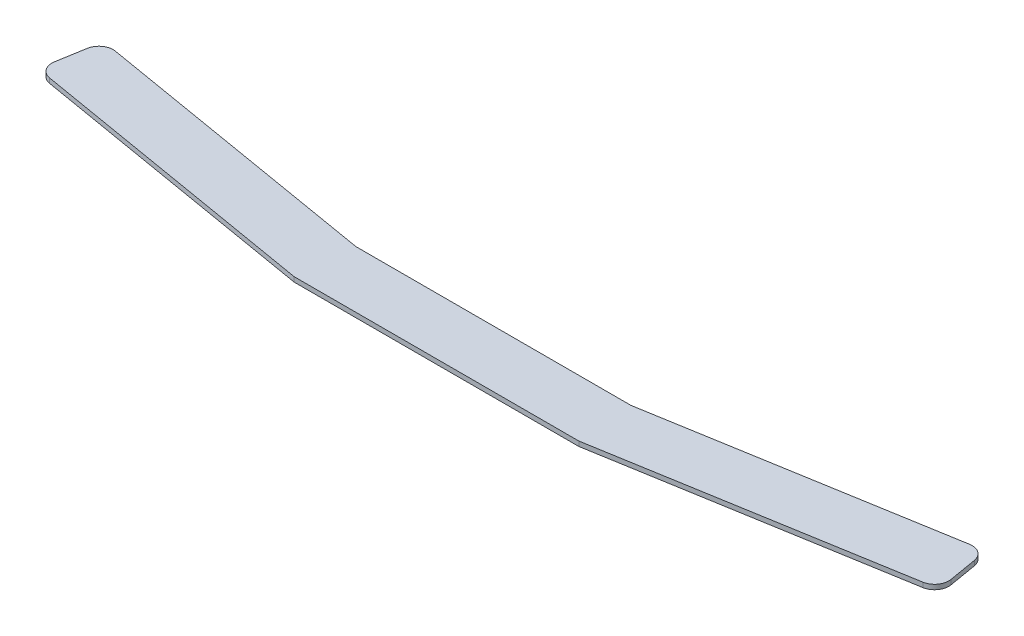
ISO-10303-21;
HEADER;
FILE_DESCRIPTION(('STEP AP214'),'2;1');
FILE_NAME('part.step','',(''),(''),'','','');
FILE_SCHEMA(('AUTOMOTIVE_DESIGN { 1 0 10303 214 1 1 1 1 }'));
ENDSEC;
DATA;
#1=APPLICATION_CONTEXT('core data for automotive mechanical design processes');
#2=APPLICATION_PROTOCOL_DEFINITION('international standard','automotive_design',2000,#1);
#3=PRODUCT_CONTEXT('',#1,'mechanical');
#4=PRODUCT('Part','Part','',(#3));
#5=PRODUCT_RELATED_PRODUCT_CATEGORY('part','',(#4));
#6=PRODUCT_DEFINITION_FORMATION('','',#4);
#7=PRODUCT_DEFINITION_CONTEXT('part definition',#1,'design');
#8=PRODUCT_DEFINITION('design','',#6,#7);
#9=PRODUCT_DEFINITION_SHAPE('','',#8);
#10=(LENGTH_UNIT() NAMED_UNIT(*) SI_UNIT(.MILLI.,.METRE.));
#11=(NAMED_UNIT(*) PLANE_ANGLE_UNIT() SI_UNIT($,.RADIAN.));
#12=(NAMED_UNIT(*) SI_UNIT($,.STERADIAN.) SOLID_ANGLE_UNIT());
#13=UNCERTAINTY_MEASURE_WITH_UNIT(LENGTH_MEASURE(1.E-05),#10,'distance_accuracy_value','');
#14=(GEOMETRIC_REPRESENTATION_CONTEXT(3) GLOBAL_UNCERTAINTY_ASSIGNED_CONTEXT((#13)) GLOBAL_UNIT_ASSIGNED_CONTEXT((#10,
#11,#12)) REPRESENTATION_CONTEXT('',''));
#15=CARTESIAN_POINT('',(0.,0.,0.));
#16=DIRECTION('',(0.,0.,1.));
#17=DIRECTION('',(1.,0.,0.));
#18=AXIS2_PLACEMENT_3D('',#15,#16,#17);
#19=CARTESIAN_POINT('',(30.0000000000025,1.,0.));
#20=DIRECTION('',(-0.166858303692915,0.,-0.985980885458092));
#21=DIRECTION('',(-0.985980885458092,0.,0.166858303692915));
#22=AXIS2_PLACEMENT_3D('',#19,#20,#21);
#23=PLANE('',#22);
#24=DIRECTION('',(0.985980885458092,0.,-0.166858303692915));
#25=VECTOR('',#24,1.);
#26=CARTESIAN_POINT('',(30.0000000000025,0.,0.));
#27=LINE('',#26,#25);
#28=CARTESIAN_POINT('',(30.0000000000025,0.,0.));
#29=VERTEX_POINT('',#28);
#30=CARTESIAN_POINT('',(92.0420573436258,0.,-10.4994250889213));
#31=VERTEX_POINT('',#30);
#32=EDGE_CURVE('E153',#29,#31,#27,.T.);
#33=ORIENTED_EDGE('',*,*,#32,.T.);
#34=DIRECTION('',(0.,-1.,0.));
#35=VECTOR('',#34,1.);
#36=CARTESIAN_POINT('',(92.0420573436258,1.,-10.4994250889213));
#37=LINE('',#36,#35);
#38=CARTESIAN_POINT('',(92.0420573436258,1.,-10.4994250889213));
#39=VERTEX_POINT('',#38);
#40=EDGE_CURVE('E11',#39,#31,#37,.T.);
#41=ORIENTED_EDGE('',*,*,#40,.F.);
#42=DIRECTION('',(0.985980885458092,0.,-0.166858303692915));
#43=VECTOR('',#42,1.);
#44=CARTESIAN_POINT('',(30.0000000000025,1.,0.));
#45=LINE('',#44,#43);
#46=CARTESIAN_POINT('',(30.0000000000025,1.,0.));
#47=VERTEX_POINT('',#46);
#48=EDGE_CURVE('E175',#47,#39,#45,.T.);
#49=ORIENTED_EDGE('',*,*,#48,.F.);
#50=DIRECTION('',(0.,-1.,0.));
#51=VECTOR('',#50,1.);
#52=CARTESIAN_POINT('',(30.0000000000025,1.,0.));
#53=LINE('',#52,#51);
#54=EDGE_CURVE('E149',#47,#29,#53,.T.);
#55=ORIENTED_EDGE('',*,*,#54,.T.);
#56=EDGE_LOOP('',(#33,#41,#49,#55));
#57=FACE_BOUND('',#56,.T.);
#58=ADVANCED_FACE('F33',(#57),#23,.F.);
#59=CARTESIAN_POINT('',(91.541482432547,1.,-13.4573677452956));
#60=DIRECTION('',(0.,-1.,0.));
#61=DIRECTION('',(0.,0.,-1.));
#62=AXIS2_PLACEMENT_3D('',#59,#60,#61);
#63=CYLINDRICAL_SURFACE('',#62,3.00000000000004);
#64=CARTESIAN_POINT('',(91.541482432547,0.,-13.4573677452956));
#65=DIRECTION('',(0.,1.,0.));
#66=DIRECTION('',(0.,0.,1.));
#67=AXIS2_PLACEMENT_3D('',#64,#65,#66);
#68=CIRCLE('',#67,3.00000000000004);
#69=CARTESIAN_POINT('',(94.4994250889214,0.,-13.9579426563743));
#70=VERTEX_POINT('',#69);
#71=EDGE_CURVE('E156',#31,#70,#68,.T.);
#72=ORIENTED_EDGE('',*,*,#71,.T.);
#73=DIRECTION('',(0.,-1.,0.));
#74=VECTOR('',#73,1.);
#75=CARTESIAN_POINT('',(94.4994250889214,1.,-13.9579426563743));
#76=LINE('',#75,#74);
#77=CARTESIAN_POINT('',(94.4994250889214,1.,-13.9579426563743));
#78=VERTEX_POINT('',#77);
#79=EDGE_CURVE('E41',#78,#70,#76,.T.);
#80=ORIENTED_EDGE('',*,*,#79,.F.);
#81=CARTESIAN_POINT('',(91.541482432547,1.,-13.4573677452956));
#82=DIRECTION('',(0.,1.,0.));
#83=DIRECTION('',(0.,0.,1.));
#84=AXIS2_PLACEMENT_3D('',#81,#82,#83);
#85=CIRCLE('',#84,3.00000000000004);
#86=EDGE_CURVE('E104',#39,#78,#85,.T.);
#87=ORIENTED_EDGE('',*,*,#86,.F.);
#88=ORIENTED_EDGE('',*,*,#40,.T.);
#89=EDGE_LOOP('',(#72,#80,#87,#88));
#90=FACE_BOUND('',#89,.T.);
#91=ADVANCED_FACE('F253',(#90),#63,.T.);
#92=CARTESIAN_POINT('',(94.4994250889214,1.,-13.9579426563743));
#93=DIRECTION('',(-0.985980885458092,0.,0.166858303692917));
#94=DIRECTION('',(0.166858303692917,0.,0.985980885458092));
#95=AXIS2_PLACEMENT_3D('',#92,#93,#94);
#96=PLANE('',#95);
#97=DIRECTION('',(-0.166858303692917,0.,-0.985980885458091));
#98=VECTOR('',#97,1.);
#99=CARTESIAN_POINT('',(94.4994250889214,0.,-13.9579426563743));
#100=LINE('',#99,#98);
#101=CARTESIAN_POINT('',(93.4982752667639,0.,-19.8738279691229));
#102=VERTEX_POINT('',#101);
#103=EDGE_CURVE('E158',#70,#102,#100,.T.);
#104=ORIENTED_EDGE('',*,*,#103,.T.);
#105=DIRECTION('',(0.,-1.,0.));
#106=VECTOR('',#105,1.);
#107=CARTESIAN_POINT('',(93.4982752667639,1.,-19.8738279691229));
#108=LINE('',#107,#106);
#109=CARTESIAN_POINT('',(93.4982752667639,1.,-19.8738279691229));
#110=VERTEX_POINT('',#109);
#111=EDGE_CURVE('E194',#110,#102,#108,.T.);
#112=ORIENTED_EDGE('',*,*,#111,.F.);
#113=DIRECTION('',(-0.166858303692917,0.,-0.985980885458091));
#114=VECTOR('',#113,1.);
#115=CARTESIAN_POINT('',(94.4994250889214,1.,-13.9579426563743));
#116=LINE('',#115,#114);
#117=EDGE_CURVE('E202',#78,#110,#116,.T.);
#118=ORIENTED_EDGE('',*,*,#117,.F.);
#119=ORIENTED_EDGE('',*,*,#79,.T.);
#120=EDGE_LOOP('',(#104,#112,#118,#119));
#121=FACE_BOUND('',#120,.T.);
#122=ADVANCED_FACE('F200',(#121),#96,.F.);
#123=CARTESIAN_POINT('',(90.5403326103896,1.,-19.3732530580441));
#124=DIRECTION('',(0.,-1.,0.));
#125=DIRECTION('',(0.,0.,-1.));
#126=AXIS2_PLACEMENT_3D('',#123,#124,#125);
#127=CYLINDRICAL_SURFACE('',#126,3.00000000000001);
#128=CARTESIAN_POINT('',(90.5403326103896,0.,-19.3732530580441));
#129=DIRECTION('',(0.,1.,0.));
#130=DIRECTION('',(0.,0.,1.));
#131=AXIS2_PLACEMENT_3D('',#128,#129,#130);
#132=CIRCLE('',#131,3.00000000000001);
#133=CARTESIAN_POINT('',(90.0397576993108,0.,-22.3311957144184));
#134=VERTEX_POINT('',#133);
#135=EDGE_CURVE('E160',#102,#134,#132,.T.);
#136=ORIENTED_EDGE('',*,*,#135,.T.);
#137=DIRECTION('',(0.,-1.,0.));
#138=VECTOR('',#137,1.);
#139=CARTESIAN_POINT('',(90.0397576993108,1.,-22.3311957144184));
#140=LINE('',#139,#138);
#141=CARTESIAN_POINT('',(90.0397576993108,1.,-22.3311957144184));
#142=VERTEX_POINT('',#141);
#143=EDGE_CURVE('E191',#142,#134,#140,.T.);
#144=ORIENTED_EDGE('',*,*,#143,.F.);
#145=CARTESIAN_POINT('',(90.5403326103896,1.,-19.3732530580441));
#146=DIRECTION('',(0.,1.,0.));
#147=DIRECTION('',(0.,0.,1.));
#148=AXIS2_PLACEMENT_3D('',#145,#146,#147);
#149=CIRCLE('',#148,3.00000000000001);
#150=EDGE_CURVE('E220',#110,#142,#149,.T.);
#151=ORIENTED_EDGE('',*,*,#150,.F.);
#152=ORIENTED_EDGE('',*,*,#111,.T.);
#153=EDGE_LOOP('',(#136,#144,#151,#152));
#154=FACE_BOUND('',#153,.T.);
#155=ADVANCED_FACE('F211',(#154),#127,.T.);
#156=CARTESIAN_POINT('',(28.9917830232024,1.,-11.9999999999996));
#157=DIRECTION('',(0.166858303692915,0.,0.985980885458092));
#158=DIRECTION('',(0.985980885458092,0.,-0.166858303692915));
#159=AXIS2_PLACEMENT_3D('',#156,#157,#158);
#160=PLANE('',#159);
#161=DIRECTION('',(-0.985980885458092,0.,0.166858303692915));
#162=VECTOR('',#161,1.);
#163=CARTESIAN_POINT('',(28.9917830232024,0.,-11.9999999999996));
#164=LINE('',#163,#162);
#165=CARTESIAN_POINT('',(28.9917830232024,0.,-11.9999999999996));
#166=VERTEX_POINT('',#165);
#167=EDGE_CURVE('E162',#134,#166,#164,.T.);
#168=ORIENTED_EDGE('',*,*,#167,.T.);
#169=DIRECTION('',(0.,-1.,0.));
#170=VECTOR('',#169,1.);
#171=CARTESIAN_POINT('',(28.9917830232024,1.,-11.9999999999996));
#172=LINE('',#171,#170);
#173=CARTESIAN_POINT('',(28.9917830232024,1.,-11.9999999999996));
#174=VERTEX_POINT('',#173);
#175=EDGE_CURVE('E188',#174,#166,#172,.T.);
#176=ORIENTED_EDGE('',*,*,#175,.F.);
#177=DIRECTION('',(-0.985980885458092,0.,0.166858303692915));
#178=VECTOR('',#177,1.);
#179=CARTESIAN_POINT('',(28.9917830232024,1.,-11.9999999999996));
#180=LINE('',#179,#178);
#181=EDGE_CURVE('E217',#142,#174,#180,.T.);
#182=ORIENTED_EDGE('',*,*,#181,.F.);
#183=ORIENTED_EDGE('',*,*,#143,.T.);
#184=EDGE_LOOP('',(#168,#176,#182,#183));
#185=FACE_BOUND('',#184,.T.);
#186=ADVANCED_FACE('F215',(#185),#160,.F.);
#187=CARTESIAN_POINT('',(-28.9917830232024,1.,-11.9999999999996));
#188=DIRECTION('',(0.,0.,1.));
#189=DIRECTION('',(1.,0.,0.));
#190=AXIS2_PLACEMENT_3D('',#187,#188,#189);
#191=PLANE('',#190);
#192=DIRECTION('',(-1.,0.,0.));
#193=VECTOR('',#192,1.);
#194=CARTESIAN_POINT('',(-28.9917830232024,0.,-11.9999999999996));
#195=LINE('',#194,#193);
#196=CARTESIAN_POINT('',(-28.9917830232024,0.,-11.9999999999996));
#197=VERTEX_POINT('',#196);
#198=EDGE_CURVE('E164',#166,#197,#195,.T.);
#199=ORIENTED_EDGE('',*,*,#198,.T.);
#200=DIRECTION('',(0.,-1.,0.));
#201=VECTOR('',#200,1.);
#202=CARTESIAN_POINT('',(-28.9917830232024,1.,-11.9999999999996));
#203=LINE('',#202,#201);
#204=CARTESIAN_POINT('',(-28.9917830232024,1.,-11.9999999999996));
#205=VERTEX_POINT('',#204);
#206=EDGE_CURVE('E185',#205,#197,#203,.T.);
#207=ORIENTED_EDGE('',*,*,#206,.F.);
#208=DIRECTION('',(-1.,0.,0.));
#209=VECTOR('',#208,1.);
#210=CARTESIAN_POINT('',(-28.9917830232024,1.,-11.9999999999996));
#211=LINE('',#210,#209);
#212=EDGE_CURVE('E219',#174,#205,#211,.T.);
#213=ORIENTED_EDGE('',*,*,#212,.F.);
#214=ORIENTED_EDGE('',*,*,#175,.T.);
#215=EDGE_LOOP('',(#199,#207,#213,#214));
#216=FACE_BOUND('',#215,.T.);
#217=ADVANCED_FACE('F266',(#216),#191,.F.);
#218=CARTESIAN_POINT('',(-28.9917830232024,1.,-11.9999999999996));
#219=DIRECTION('',(-0.166858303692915,0.,0.985980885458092));
#220=DIRECTION('',(0.985980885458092,0.,0.166858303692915));
#221=AXIS2_PLACEMENT_3D('',#218,#219,#220);
#222=PLANE('',#221);
#223=DIRECTION('',(-0.985980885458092,0.,-0.166858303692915));
#224=VECTOR('',#223,1.);
#225=CARTESIAN_POINT('',(-28.9917830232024,0.,-11.9999999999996));
#226=LINE('',#225,#224);
#227=CARTESIAN_POINT('',(-90.0397576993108,0.,-22.3311957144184));
#228=VERTEX_POINT('',#227);
#229=EDGE_CURVE('E166',#197,#228,#226,.T.);
#230=ORIENTED_EDGE('',*,*,#229,.T.);
#231=DIRECTION('',(0.,-1.,0.));
#232=VECTOR('',#231,1.);
#233=CARTESIAN_POINT('',(-90.0397576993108,1.,-22.3311957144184));
#234=LINE('',#233,#232);
#235=CARTESIAN_POINT('',(-90.0397576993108,1.,-22.3311957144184));
#236=VERTEX_POINT('',#235);
#237=EDGE_CURVE('E182',#236,#228,#234,.T.);
#238=ORIENTED_EDGE('',*,*,#237,.F.);
#239=DIRECTION('',(-0.985980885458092,0.,-0.166858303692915));
#240=VECTOR('',#239,1.);
#241=CARTESIAN_POINT('',(-28.9917830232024,1.,-11.9999999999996));
#242=LINE('',#241,#240);
#243=EDGE_CURVE('E222',#205,#236,#242,.T.);
#244=ORIENTED_EDGE('',*,*,#243,.F.);
#245=ORIENTED_EDGE('',*,*,#206,.T.);
#246=EDGE_LOOP('',(#230,#238,#244,#245));
#247=FACE_BOUND('',#246,.T.);
#248=ADVANCED_FACE('F269',(#247),#222,.F.);
#249=CARTESIAN_POINT('',(-90.5403326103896,1.,-19.3732530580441));
#250=DIRECTION('',(0.,-1.,0.));
#251=DIRECTION('',(0.,0.,-1.));
#252=AXIS2_PLACEMENT_3D('',#249,#250,#251);
#253=CYLINDRICAL_SURFACE('',#252,3.00000000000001);
#254=CARTESIAN_POINT('',(-90.5403326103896,0.,-19.3732530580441));
#255=DIRECTION('',(0.,1.,0.));
#256=DIRECTION('',(0.,0.,-1.));
#257=AXIS2_PLACEMENT_3D('',#254,#255,#256);
#258=CIRCLE('',#257,3.00000000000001);
#259=CARTESIAN_POINT('',(-93.4982752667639,0.,-19.8738279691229));
#260=VERTEX_POINT('',#259);
#261=EDGE_CURVE('E168',#228,#260,#258,.T.);
#262=ORIENTED_EDGE('',*,*,#261,.T.);
#263=DIRECTION('',(0.,-1.,0.));
#264=VECTOR('',#263,1.);
#265=CARTESIAN_POINT('',(-93.4982752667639,1.,-19.8738279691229));
#266=LINE('',#265,#264);
#267=CARTESIAN_POINT('',(-93.4982752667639,1.,-19.8738279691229));
#268=VERTEX_POINT('',#267);
#269=EDGE_CURVE('E179',#268,#260,#266,.T.);
#270=ORIENTED_EDGE('',*,*,#269,.F.);
#271=CARTESIAN_POINT('',(-90.5403326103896,1.,-19.3732530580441));
#272=DIRECTION('',(0.,1.,0.));
#273=DIRECTION('',(0.,0.,-1.));
#274=AXIS2_PLACEMENT_3D('',#271,#272,#273);
#275=CIRCLE('',#274,3.00000000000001);
#276=EDGE_CURVE('E228',#236,#268,#275,.T.);
#277=ORIENTED_EDGE('',*,*,#276,.F.);
#278=ORIENTED_EDGE('',*,*,#237,.T.);
#279=EDGE_LOOP('',(#262,#270,#277,#278));
#280=FACE_BOUND('',#279,.T.);
#281=ADVANCED_FACE('F234',(#280),#253,.T.);
#282=CARTESIAN_POINT('',(-94.4994250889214,1.,-13.9579426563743));
#283=DIRECTION('',(0.985980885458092,0.,0.166858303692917));
#284=DIRECTION('',(0.166858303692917,0.,-0.985980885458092));
#285=AXIS2_PLACEMENT_3D('',#282,#283,#284);
#286=PLANE('',#285);
#287=DIRECTION('',(-0.166858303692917,0.,0.985980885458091));
#288=VECTOR('',#287,1.);
#289=CARTESIAN_POINT('',(-94.4994250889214,0.,-13.9579426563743));
#290=LINE('',#289,#288);
#291=CARTESIAN_POINT('',(-94.4994250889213,0.,-13.9579426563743));
#292=VERTEX_POINT('',#291);
#293=EDGE_CURVE('E170',#260,#292,#290,.T.);
#294=ORIENTED_EDGE('',*,*,#293,.T.);
#295=DIRECTION('',(0.,-1.,0.));
#296=VECTOR('',#295,1.);
#297=CARTESIAN_POINT('',(-94.4994250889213,1.,-13.9579426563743));
#298=LINE('',#297,#296);
#299=CARTESIAN_POINT('',(-94.4994250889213,1.,-13.9579426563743));
#300=VERTEX_POINT('',#299);
#301=EDGE_CURVE('E144',#300,#292,#298,.T.);
#302=ORIENTED_EDGE('',*,*,#301,.F.);
#303=DIRECTION('',(-0.166858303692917,0.,0.985980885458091));
#304=VECTOR('',#303,1.);
#305=CARTESIAN_POINT('',(-94.4994250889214,1.,-13.9579426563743));
#306=LINE('',#305,#304);
#307=EDGE_CURVE('E135',#268,#300,#306,.T.);
#308=ORIENTED_EDGE('',*,*,#307,.F.);
#309=ORIENTED_EDGE('',*,*,#269,.T.);
#310=EDGE_LOOP('',(#294,#302,#308,#309));
#311=FACE_BOUND('',#310,.T.);
#312=ADVANCED_FACE('F238',(#311),#286,.F.);
#313=CARTESIAN_POINT('',(-91.541482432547,1.,-13.4573677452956));
#314=DIRECTION('',(0.,-1.,0.));
#315=DIRECTION('',(0.,0.,-1.));
#316=AXIS2_PLACEMENT_3D('',#313,#314,#315);
#317=CYLINDRICAL_SURFACE('',#316,3.00000000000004);
#318=CARTESIAN_POINT('',(-91.541482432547,0.,-13.4573677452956));
#319=DIRECTION('',(0.,1.,0.));
#320=DIRECTION('',(0.,0.,-1.));
#321=AXIS2_PLACEMENT_3D('',#318,#319,#320);
#322=CIRCLE('',#321,3.00000000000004);
#323=CARTESIAN_POINT('',(-92.0420573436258,0.,-10.4994250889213));
#324=VERTEX_POINT('',#323);
#325=EDGE_CURVE('E143',#292,#324,#322,.T.);
#326=ORIENTED_EDGE('',*,*,#325,.T.);
#327=DIRECTION('',(0.,-1.,0.));
#328=VECTOR('',#327,1.);
#329=CARTESIAN_POINT('',(-92.0420573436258,1.,-10.4994250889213));
#330=LINE('',#329,#328);
#331=CARTESIAN_POINT('',(-92.0420573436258,1.,-10.4994250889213));
#332=VERTEX_POINT('',#331);
#333=EDGE_CURVE('E140',#332,#324,#330,.T.);
#334=ORIENTED_EDGE('',*,*,#333,.F.);
#335=CARTESIAN_POINT('',(-91.541482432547,1.,-13.4573677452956));
#336=DIRECTION('',(0.,1.,0.));
#337=DIRECTION('',(0.,0.,-1.));
#338=AXIS2_PLACEMENT_3D('',#335,#336,#337);
#339=CIRCLE('',#338,3.00000000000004);
#340=EDGE_CURVE('E129',#300,#332,#339,.T.);
#341=ORIENTED_EDGE('',*,*,#340,.F.);
#342=ORIENTED_EDGE('',*,*,#301,.T.);
#343=EDGE_LOOP('',(#326,#334,#341,#342));
#344=FACE_BOUND('',#343,.T.);
#345=ADVANCED_FACE('F141',(#344),#317,.T.);
#346=CARTESIAN_POINT('',(-30.0000000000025,1.,0.));
#347=DIRECTION('',(0.166858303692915,0.,-0.985980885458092));
#348=DIRECTION('',(-0.985980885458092,0.,-0.166858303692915));
#349=AXIS2_PLACEMENT_3D('',#346,#347,#348);
#350=PLANE('',#349);
#351=DIRECTION('',(0.985980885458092,0.,0.166858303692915));
#352=VECTOR('',#351,1.);
#353=CARTESIAN_POINT('',(-30.0000000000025,0.,0.));
#354=LINE('',#353,#352);
#355=CARTESIAN_POINT('',(-30.0000000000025,0.,0.));
#356=VERTEX_POINT('',#355);
#357=EDGE_CURVE('E90',#324,#356,#354,.T.);
#358=ORIENTED_EDGE('',*,*,#357,.T.);
#359=DIRECTION('',(0.,-1.,0.));
#360=VECTOR('',#359,1.);
#361=CARTESIAN_POINT('',(-30.0000000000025,1.,0.));
#362=LINE('',#361,#360);
#363=CARTESIAN_POINT('',(-30.0000000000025,1.,0.));
#364=VERTEX_POINT('',#363);
#365=EDGE_CURVE('E145',#364,#356,#362,.T.);
#366=ORIENTED_EDGE('',*,*,#365,.F.);
#367=DIRECTION('',(0.985980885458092,0.,0.166858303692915));
#368=VECTOR('',#367,1.);
#369=CARTESIAN_POINT('',(-30.0000000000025,1.,0.));
#370=LINE('',#369,#368);
#371=EDGE_CURVE('E133',#332,#364,#370,.T.);
#372=ORIENTED_EDGE('',*,*,#371,.F.);
#373=ORIENTED_EDGE('',*,*,#333,.T.);
#374=EDGE_LOOP('',(#358,#366,#372,#373));
#375=FACE_BOUND('',#374,.T.);
#376=ADVANCED_FACE('F147',(#375),#350,.F.);
#377=CARTESIAN_POINT('',(-30.0000000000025,1.,0.));
#378=DIRECTION('',(0.,0.,-1.));
#379=DIRECTION('',(-1.,0.,0.));
#380=AXIS2_PLACEMENT_3D('',#377,#378,#379);
#381=PLANE('',#380);
#382=DIRECTION('',(1.,0.,0.));
#383=VECTOR('',#382,1.);
#384=CARTESIAN_POINT('',(-30.0000000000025,0.,0.));
#385=LINE('',#384,#383);
#386=EDGE_CURVE('E96',#356,#29,#385,.T.);
#387=ORIENTED_EDGE('',*,*,#386,.T.);
#388=ORIENTED_EDGE('',*,*,#54,.F.);
#389=DIRECTION('',(1.,0.,0.));
#390=VECTOR('',#389,1.);
#391=CARTESIAN_POINT('',(-30.0000000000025,1.,0.));
#392=LINE('',#391,#390);
#393=EDGE_CURVE('E49',#364,#47,#392,.T.);
#394=ORIENTED_EDGE('',*,*,#393,.F.);
#395=ORIENTED_EDGE('',*,*,#365,.T.);
#396=EDGE_LOOP('',(#387,#388,#394,#395));
#397=FACE_BOUND('',#396,.T.);
#398=ADVANCED_FACE('F242',(#397),#381,.F.);
#399=CARTESIAN_POINT('',(91.541482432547,1.,-13.4573677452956));
#400=DIRECTION('',(0.,1.,0.));
#401=DIRECTION('',(0.,0.,1.));
#402=AXIS2_PLACEMENT_3D('',#399,#400,#401);
#403=PLANE('',#402);
#404=ORIENTED_EDGE('',*,*,#48,.T.);
#405=ORIENTED_EDGE('',*,*,#86,.T.);
#406=ORIENTED_EDGE('',*,*,#117,.T.);
#407=ORIENTED_EDGE('',*,*,#150,.T.);
#408=ORIENTED_EDGE('',*,*,#181,.T.);
#409=ORIENTED_EDGE('',*,*,#212,.T.);
#410=ORIENTED_EDGE('',*,*,#243,.T.);
#411=ORIENTED_EDGE('',*,*,#276,.T.);
#412=ORIENTED_EDGE('',*,*,#307,.T.);
#413=ORIENTED_EDGE('',*,*,#340,.T.);
#414=ORIENTED_EDGE('',*,*,#371,.T.);
#415=ORIENTED_EDGE('',*,*,#393,.T.);
#416=EDGE_LOOP('',(#404,#405,#406,#407,#408,#409,#410,#411,#412,#413,#414,#415));
#417=FACE_BOUND('',#416,.T.);
#418=ADVANCED_FACE('F131',(#417),#403,.T.);
#419=CARTESIAN_POINT('',(91.541482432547,0.,-13.4573677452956));
#420=DIRECTION('',(0.,1.,0.));
#421=DIRECTION('',(0.,0.,1.));
#422=AXIS2_PLACEMENT_3D('',#419,#420,#421);
#423=PLANE('',#422);
#424=ORIENTED_EDGE('',*,*,#32,.F.);
#425=ORIENTED_EDGE('',*,*,#386,.F.);
#426=ORIENTED_EDGE('',*,*,#357,.F.);
#427=ORIENTED_EDGE('',*,*,#325,.F.);
#428=ORIENTED_EDGE('',*,*,#293,.F.);
#429=ORIENTED_EDGE('',*,*,#261,.F.);
#430=ORIENTED_EDGE('',*,*,#229,.F.);
#431=ORIENTED_EDGE('',*,*,#198,.F.);
#432=ORIENTED_EDGE('',*,*,#167,.F.);
#433=ORIENTED_EDGE('',*,*,#135,.F.);
#434=ORIENTED_EDGE('',*,*,#103,.F.);
#435=ORIENTED_EDGE('',*,*,#71,.F.);
#436=EDGE_LOOP('',(#424,#425,#426,#427,#428,#429,#430,#431,#432,#433,#434,#435));
#437=FACE_BOUND('',#436,.T.);
#438=ADVANCED_FACE('F206',(#437),#423,.F.);
#439=CLOSED_SHELL('',(#58,#91,#122,#155,#186,#217,#248,#281,#312,#345,#376,#398,#418,#438));
#440=MANIFOLD_SOLID_BREP('B2',#439);
#441=ADVANCED_BREP_SHAPE_REPRESENTATION('',(#18,#440),#14);
#442=SHAPE_DEFINITION_REPRESENTATION(#9,#441);
ENDSEC;
END-ISO-10303-21;
